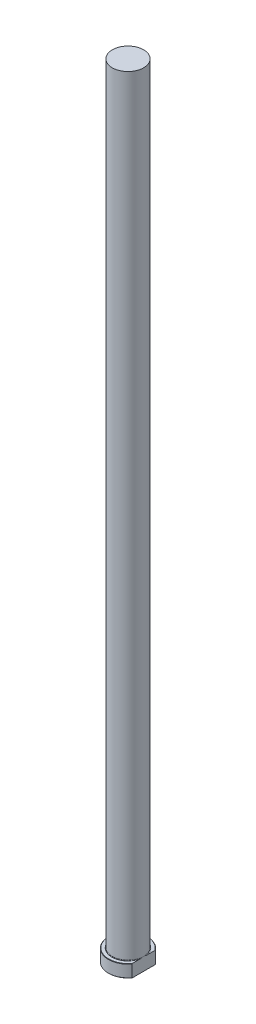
ISO-10303-21;
HEADER;
FILE_DESCRIPTION(('STEP AP214'),'2;1');
FILE_NAME('part.step','',(''),(''),'','','');
FILE_SCHEMA(('AUTOMOTIVE_DESIGN { 1 0 10303 214 1 1 1 1 }'));
ENDSEC;
DATA;
#1=APPLICATION_CONTEXT('core data for automotive mechanical design processes');
#2=APPLICATION_PROTOCOL_DEFINITION('international standard','automotive_design',2000,#1);
#3=PRODUCT_CONTEXT('',#1,'mechanical');
#4=PRODUCT('Part','Part','',(#3));
#5=PRODUCT_RELATED_PRODUCT_CATEGORY('part','',(#4));
#6=PRODUCT_DEFINITION_FORMATION('','',#4);
#7=PRODUCT_DEFINITION_CONTEXT('part definition',#1,'design');
#8=PRODUCT_DEFINITION('design','',#6,#7);
#9=PRODUCT_DEFINITION_SHAPE('','',#8);
#10=(LENGTH_UNIT() NAMED_UNIT(*) SI_UNIT(.MILLI.,.METRE.));
#11=(NAMED_UNIT(*) PLANE_ANGLE_UNIT() SI_UNIT($,.RADIAN.));
#12=(NAMED_UNIT(*) SI_UNIT($,.STERADIAN.) SOLID_ANGLE_UNIT());
#13=UNCERTAINTY_MEASURE_WITH_UNIT(LENGTH_MEASURE(1.E-05),#10,'distance_accuracy_value','');
#14=(GEOMETRIC_REPRESENTATION_CONTEXT(3) GLOBAL_UNCERTAINTY_ASSIGNED_CONTEXT((#13)) GLOBAL_UNIT_ASSIGNED_CONTEXT((#10,
#11,#12)) REPRESENTATION_CONTEXT('',''));
#15=CARTESIAN_POINT('',(0.,0.,0.));
#16=DIRECTION('',(0.,0.,1.));
#17=DIRECTION('',(1.,0.,0.));
#18=AXIS2_PLACEMENT_3D('',#15,#16,#17);
#19=CARTESIAN_POINT('',(0.,0.,0.));
#20=DIRECTION('',(0.,-1.,0.));
#21=DIRECTION('',(0.,0.,-1.));
#22=AXIS2_PLACEMENT_3D('',#19,#20,#21);
#23=PLANE('',#22);
#24=CARTESIAN_POINT('',(0.,0.,0.));
#25=DIRECTION('',(0.,-1.,0.));
#26=DIRECTION('',(0.,0.,-1.));
#27=AXIS2_PLACEMENT_3D('',#24,#25,#26);
#28=CIRCLE('',#27,12.3);
#29=CARTESIAN_POINT('',(9.99999999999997,0.,7.16170370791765));
#30=VERTEX_POINT('',#29);
#31=CARTESIAN_POINT('',(9.99999999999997,0.,-7.16170370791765));
#32=VERTEX_POINT('',#31);
#33=EDGE_CURVE('E98',#30,#32,#28,.T.);
#34=ORIENTED_EDGE('',*,*,#33,.T.);
#35=DIRECTION('',(0.,0.,1.));
#36=VECTOR('',#35,1.);
#37=CARTESIAN_POINT('',(9.99999999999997,0.,7.49999999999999));
#38=LINE('',#37,#36);
#39=EDGE_CURVE('E83',#32,#30,#38,.T.);
#40=ORIENTED_EDGE('',*,*,#39,.T.);
#41=EDGE_LOOP('',(#34,#40));
#42=FACE_BOUND('',#41,.T.);
#43=ADVANCED_FACE('F32',(#42),#23,.T.);
#44=CARTESIAN_POINT('',(0.,259.958771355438,0.));
#45=DIRECTION('',(0.,1.,0.));
#46=DIRECTION('',(0.,0.,1.));
#47=AXIS2_PLACEMENT_3D('',#44,#45,#46);
#48=CYLINDRICAL_SURFACE('',#47,12.5);
#49=CARTESIAN_POINT('',(0.,7.79999999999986,0.));
#50=DIRECTION('',(0.,1.,0.));
#51=DIRECTION('',(0.,0.,1.));
#52=AXIS2_PLACEMENT_3D('',#49,#50,#51);
#53=CIRCLE('',#52,12.5);
#54=CARTESIAN_POINT('',(9.99999999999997,7.79999999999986,7.49999999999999));
#55=VERTEX_POINT('',#54);
#56=CARTESIAN_POINT('',(9.99999999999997,7.79999999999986,-7.49999999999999));
#57=VERTEX_POINT('',#56);
#58=EDGE_CURVE('E104',#55,#57,#53,.F.);
#59=ORIENTED_EDGE('',*,*,#58,.T.);
#60=DIRECTION('',(0.,-1.,0.));
#61=VECTOR('',#60,1.);
#62=CARTESIAN_POINT('',(9.99999999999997,500.,-7.49999999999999));
#63=LINE('',#62,#61);
#64=CARTESIAN_POINT('',(9.99999999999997,0.199999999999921,-7.49999999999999));
#65=VERTEX_POINT('',#64);
#66=EDGE_CURVE('E183',#57,#65,#63,.T.);
#67=ORIENTED_EDGE('',*,*,#66,.T.);
#68=CARTESIAN_POINT('',(0.,0.199999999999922,0.));
#69=DIRECTION('',(0.,-1.,0.));
#70=DIRECTION('',(0.,0.,-1.));
#71=AXIS2_PLACEMENT_3D('',#68,#69,#70);
#72=CIRCLE('',#71,12.5);
#73=CARTESIAN_POINT('',(9.99999999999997,0.199999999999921,7.49999999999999));
#74=VERTEX_POINT('',#73);
#75=EDGE_CURVE('E100',#65,#74,#72,.F.);
#76=ORIENTED_EDGE('',*,*,#75,.T.);
#77=DIRECTION('',(0.,-1.,0.));
#78=VECTOR('',#77,1.);
#79=CARTESIAN_POINT('',(9.99999999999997,500.,7.49999999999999));
#80=LINE('',#79,#78);
#81=EDGE_CURVE('E93',#55,#74,#80,.T.);
#82=ORIENTED_EDGE('',*,*,#81,.F.);
#83=EDGE_LOOP('',(#59,#67,#76,#82));
#84=FACE_BOUND('',#83,.T.);
#85=ADVANCED_FACE('F158',(#84),#48,.T.);
#86=CARTESIAN_POINT('',(-12.5,8.,0.));
#87=DIRECTION('',(0.,1.,0.));
#88=DIRECTION('',(0.,0.,1.));
#89=AXIS2_PLACEMENT_3D('',#86,#87,#88);
#90=PLANE('',#89);
#91=CARTESIAN_POINT('',(0.,8.,0.));
#92=DIRECTION('',(0.,1.,0.));
#93=DIRECTION('',(0.,0.,1.));
#94=AXIS2_PLACEMENT_3D('',#91,#92,#93);
#95=CIRCLE('',#94,12.2999999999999);
#96=CARTESIAN_POINT('',(9.99999999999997,8.,-7.16170370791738));
#97=VERTEX_POINT('',#96);
#98=CARTESIAN_POINT('',(9.99999999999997,8.,7.16170370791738));
#99=VERTEX_POINT('',#98);
#100=EDGE_CURVE('E178',#97,#99,#95,.T.);
#101=ORIENTED_EDGE('',*,*,#100,.T.);
#102=DIRECTION('',(0.,0.,-1.));
#103=VECTOR('',#102,1.);
#104=CARTESIAN_POINT('',(9.99999999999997,8.,0.));
#105=LINE('',#104,#103);
#106=CARTESIAN_POINT('',(9.99999999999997,7.99999999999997,2.46779253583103));
#107=VERTEX_POINT('',#106);
#108=EDGE_CURVE('E57',#99,#107,#105,.T.);
#109=ORIENTED_EDGE('',*,*,#108,.T.);
#110=CARTESIAN_POINT('',(0.,8.,0.));
#111=DIRECTION('',(0.,1.,0.));
#112=DIRECTION('',(0.,0.,1.));
#113=AXIS2_PLACEMENT_3D('',#110,#111,#112);
#114=CIRCLE('',#113,10.3);
#115=CARTESIAN_POINT('',(9.99999999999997,7.99999999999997,-2.46779253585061));
#116=VERTEX_POINT('',#115);
#117=EDGE_CURVE('E107',#107,#116,#114,.F.);
#118=ORIENTED_EDGE('',*,*,#117,.T.);
#119=EDGE_CURVE('E136',#116,#97,#105,.T.);
#120=ORIENTED_EDGE('',*,*,#119,.T.);
#121=EDGE_LOOP('',(#101,#109,#118,#120));
#122=FACE_BOUND('',#121,.T.);
#123=ADVANCED_FACE('F147',(#122),#90,.T.);
#124=CARTESIAN_POINT('',(0.,8.00000000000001,0.));
#125=DIRECTION('',(0.,-1.,0.));
#126=DIRECTION('',(0.,0.,-1.));
#127=AXIS2_PLACEMENT_3D('',#124,#125,#126);
#128=CONICAL_SURFACE('',#127,12.2999999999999,0.78539816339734);
#129=ORIENTED_EDGE('',*,*,#58,.F.);
#130=CARTESIAN_POINT('',(9.99999999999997,1.00536344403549,16.5009999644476));
#131=CARTESIAN_POINT('',(9.99999999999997,1.21630498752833,16.2543355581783));
#132=CARTESIAN_POINT('',(9.99999999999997,1.42652357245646,16.0070509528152));
#133=CARTESIAN_POINT('',(9.99999999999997,1.84530552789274,15.5110762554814));
#134=CARTESIAN_POINT('',(9.99999999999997,2.05386886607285,15.2623861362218));
#135=CARTESIAN_POINT('',(9.99999999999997,2.46922929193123,14.7633169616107));
#136=CARTESIAN_POINT('',(9.99999999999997,2.67602541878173,14.5129371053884));
#137=CARTESIAN_POINT('',(9.99999999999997,3.08746949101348,14.0104232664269));
#138=CARTESIAN_POINT('',(9.99999999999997,3.29211744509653,13.7582892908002));
#139=CARTESIAN_POINT('',(9.99999999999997,3.91329356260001,12.9853872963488));
#140=CARTESIAN_POINT('',(9.99999999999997,4.32590780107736,12.4614457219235));
#141=CARTESIAN_POINT('',(9.99999999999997,4.9343290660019,11.667584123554));
#142=CARTESIAN_POINT('',(9.99999999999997,5.13536557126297,11.4016670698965));
#143=CARTESIAN_POINT('',(9.99999999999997,5.53332213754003,10.8667737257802));
#144=CARTESIAN_POINT('',(9.99999999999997,5.73024230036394,10.5977975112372));
#145=CARTESIAN_POINT('',(9.99999999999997,6.11958395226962,10.0558339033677));
#146=CARTESIAN_POINT('',(9.99999999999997,6.31199627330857,9.78283991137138));
#147=CARTESIAN_POINT('',(9.99999999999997,6.69098850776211,9.23281808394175));
#148=CARTESIAN_POINT('',(9.99999999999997,6.87756835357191,8.95579020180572));
#149=CARTESIAN_POINT('',(9.99999999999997,7.24386175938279,8.39686559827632));
#150=CARTESIAN_POINT('',(9.99999999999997,7.4235690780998,8.11496477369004));
#151=CARTESIAN_POINT('',(9.99999999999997,7.77442577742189,7.54587381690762));
#152=CARTESIAN_POINT('',(9.99999999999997,7.94557534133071,7.25868379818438));
#153=CARTESIAN_POINT('',(9.99999999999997,8.27579255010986,6.68110489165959));
#154=CARTESIAN_POINT('',(9.99999999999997,8.43496136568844,6.39077413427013));
#155=CARTESIAN_POINT('',(9.99999999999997,8.74070169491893,5.80346881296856));
#156=CARTESIAN_POINT('',(9.99999999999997,8.88727174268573,5.50649348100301));
#157=CARTESIAN_POINT('',(9.99999999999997,9.16464690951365,4.90580562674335));
#158=CARTESIAN_POINT('',(9.99999999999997,9.29547767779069,4.60210504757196));
#159=CARTESIAN_POINT('',(9.99999999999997,9.5381157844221,3.98721702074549));
#160=CARTESIAN_POINT('',(9.99999999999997,9.64992824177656,3.6760316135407));
#161=CARTESIAN_POINT('',(9.99999999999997,9.85377427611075,3.03618507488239));
#162=CARTESIAN_POINT('',(9.99999999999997,9.94506307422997,2.70728313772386));
#163=CARTESIAN_POINT('',(9.99999999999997,10.098612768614,2.04271295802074));
#164=CARTESIAN_POINT('',(9.99999999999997,10.1608782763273,1.70704579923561));
#165=CARTESIAN_POINT('',(9.99999999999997,10.2523345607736,1.03273145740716));
#166=CARTESIAN_POINT('',(9.99999999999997,10.2816771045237,0.694105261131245));
#167=CARTESIAN_POINT('',(9.99999999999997,10.305734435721,0.0156107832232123));
#168=CARTESIAN_POINT('',(9.99999999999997,10.3004504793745,-0.324257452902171));
#169=CARTESIAN_POINT('',(9.99999999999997,10.2556863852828,-1.00105364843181));
#170=CARTESIAN_POINT('',(9.99999999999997,10.2162696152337,-1.33798588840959));
#171=CARTESIAN_POINT('',(9.99999999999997,10.1059986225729,-2.00662252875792));
#172=CARTESIAN_POINT('',(9.99999999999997,10.0351392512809,-2.3383260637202));
#173=CARTESIAN_POINT('',(9.99999999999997,9.86555989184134,-2.99656485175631));
#174=CARTESIAN_POINT('',(9.99999999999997,9.76667373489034,-3.32305662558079));
#175=CARTESIAN_POINT('',(9.99999999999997,9.54578440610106,-3.96799531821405));
#176=CARTESIAN_POINT('',(9.99999999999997,9.42378209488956,-4.28644253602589));
#177=CARTESIAN_POINT('',(9.99999999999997,9.11799425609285,-5.01807395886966));
#178=CARTESIAN_POINT('',(9.99999999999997,8.92704202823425,-5.42824387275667));
#179=CARTESIAN_POINT('',(9.99999999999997,8.52007370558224,-6.23606279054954));
#180=CARTESIAN_POINT('',(9.99999999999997,8.30404206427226,-6.63370383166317));
#181=CARTESIAN_POINT('',(9.99999999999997,7.85262882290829,-7.41892362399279));
#182=CARTESIAN_POINT('',(9.99999999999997,7.61720565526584,-7.80647828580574));
#183=CARTESIAN_POINT('',(9.99999999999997,7.13198477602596,-8.57229930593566));
#184=CARTESIAN_POINT('',(9.99999999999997,6.88219017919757,-8.95056765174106));
#185=CARTESIAN_POINT('',(9.99999999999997,6.37025897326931,-9.70120273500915));
#186=CARTESIAN_POINT('',(9.99999999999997,6.10807036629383,-10.0735338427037));
#187=CARTESIAN_POINT('',(9.99999999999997,5.57484920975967,-10.8118088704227));
#188=CARTESIAN_POINT('',(9.99999999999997,5.30381628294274,-11.1777525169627));
#189=CARTESIAN_POINT('',(9.99999999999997,4.7550335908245,-11.9038819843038));
#190=CARTESIAN_POINT('',(9.99999999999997,4.47729204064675,-12.2640740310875));
#191=CARTESIAN_POINT('',(9.99999999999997,3.91614159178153,-12.979992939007));
#192=CARTESIAN_POINT('',(9.99999999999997,3.63273283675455,-13.3357199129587));
#193=CARTESIAN_POINT('',(9.99999999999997,3.15476557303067,-13.9276249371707));
#194=CARTESIAN_POINT('',(9.99999999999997,2.96147908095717,-14.1648328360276));
#195=CARTESIAN_POINT('',(9.99999999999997,2.57302271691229,-14.6377567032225));
#196=CARTESIAN_POINT('',(9.99999999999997,2.37785258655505,-14.8734724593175));
#197=CARTESIAN_POINT('',(9.99999999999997,1.98727926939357,-15.3418493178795));
#198=CARTESIAN_POINT('',(9.99999999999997,1.79188780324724,-15.574520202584));
#199=CARTESIAN_POINT('',(9.99999999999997,1.39966350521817,-16.0386421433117));
#200=CARTESIAN_POINT('',(9.99999999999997,1.2028306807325,-16.2700932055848));
#201=CARTESIAN_POINT('',(9.99999999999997,1.00536344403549,-16.5009999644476));
#202=B_SPLINE_CURVE_WITH_KNOTS('',3,(#130,#131,#132,#133,#134,#135,#136,#137,#138,#139,#140,
#141,#142,#143,#144,#145,#146,#147,#148,#149,#150,#151,#152,#153,#154,#155,#156,#157,#158,#159,
#160,#161,#162,#163,#164,#165,#166,#167,#168,#169,#170,#171,#172,#173,#174,#175,#176,#177,#178,
#179,#180,#181,#182,#183,#184,#185,#186,#187,#188,#189,#190,#191,#192,#193,#194,#195,#196,#197,
#198,#199,#200,#201),.UNSPECIFIED.,.F.,.F.,(4,2,2,2,2,2,2,2,2,2,2,2,2,2,2,2,2,2,2,2,2,2,2,2,2,2,
2,2,2,2,2,2,2,2,2,4),(0.,0.973682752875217,1.94738447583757,2.92158563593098,3.89578284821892,
5.89629098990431,6.89633497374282,7.89635419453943,8.898256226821,9.90016986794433,
10.9029727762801,11.9057541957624,12.8987995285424,13.8919602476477,14.883479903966,
15.8747322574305,16.8976074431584,17.9203200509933,18.9382985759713,19.9562401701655,
20.9722959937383,21.9885182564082,23.0108964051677,24.0332364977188,25.3893591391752,
26.7463269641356,28.106283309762,29.4659460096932,30.8319323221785,32.1979769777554,
33.5624260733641,34.9268406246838,35.8447887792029,36.7628646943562,37.6743531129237,
38.5858368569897),.UNSPECIFIED.);
#203=EDGE_CURVE('E135',#55,#99,#202,.T.);
#204=ORIENTED_EDGE('',*,*,#203,.T.);
#205=ORIENTED_EDGE('',*,*,#100,.F.);
#206=EDGE_CURVE('E127',#97,#57,#202,.T.);
#207=ORIENTED_EDGE('',*,*,#206,.T.);
#208=EDGE_LOOP('',(#129,#204,#205,#207));
#209=FACE_BOUND('',#208,.T.);
#210=ADVANCED_FACE('F143',(#209),#128,.T.);
#211=CARTESIAN_POINT('',(0.,0.199999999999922,0.));
#212=DIRECTION('',(0.,1.,0.));
#213=DIRECTION('',(0.,0.,1.));
#214=AXIS2_PLACEMENT_3D('',#211,#212,#213);
#215=CONICAL_SURFACE('',#214,12.5,0.785398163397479);
#216=ORIENTED_EDGE('',*,*,#75,.F.);
#217=CARTESIAN_POINT('',(9.99999999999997,6.9946365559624,-16.5009999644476));
#218=CARTESIAN_POINT('',(9.99999999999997,6.78369501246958,-16.2543355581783));
#219=CARTESIAN_POINT('',(9.99999999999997,6.57347642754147,-16.0070509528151));
#220=CARTESIAN_POINT('',(9.99999999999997,6.15469447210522,-15.5110762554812));
#221=CARTESIAN_POINT('',(9.99999999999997,5.94613113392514,-15.2623861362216));
#222=CARTESIAN_POINT('',(9.99999999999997,5.53077070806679,-14.7633169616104));
#223=CARTESIAN_POINT('',(9.99999999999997,5.32397458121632,-14.512937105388));
#224=CARTESIAN_POINT('',(9.99999999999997,4.91253050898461,-14.0104232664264));
#225=CARTESIAN_POINT('',(9.99999999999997,4.70788255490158,-13.7582892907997));
#226=CARTESIAN_POINT('',(9.99999999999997,4.08670643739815,-12.9853872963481));
#227=CARTESIAN_POINT('',(9.99999999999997,3.67409219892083,-12.4614457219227));
#228=CARTESIAN_POINT('',(9.99999999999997,3.06567093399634,-11.667584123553));
#229=CARTESIAN_POINT('',(9.99999999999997,2.86463442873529,-11.4016670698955));
#230=CARTESIAN_POINT('',(9.99999999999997,2.46667786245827,-10.8667737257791));
#231=CARTESIAN_POINT('',(9.99999999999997,2.26975769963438,-10.5977975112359));
#232=CARTESIAN_POINT('',(9.99999999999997,1.88041604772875,-10.0558339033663));
#233=CARTESIAN_POINT('',(9.99999999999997,1.68800372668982,-9.78283991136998));
#234=CARTESIAN_POINT('',(9.99999999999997,1.30901149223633,-9.23281808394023));
#235=CARTESIAN_POINT('',(9.99999999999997,1.12243164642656,-8.95579020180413));
#236=CARTESIAN_POINT('',(9.99999999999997,0.756138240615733,-8.3968655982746));
#237=CARTESIAN_POINT('',(9.99999999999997,0.576430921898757,-8.11496477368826));
#238=CARTESIAN_POINT('',(9.99999999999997,0.22557422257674,-7.54587381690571));
#239=CARTESIAN_POINT('',(9.99999999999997,0.0544246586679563,-7.25868379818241));
#240=CARTESIAN_POINT('',(9.99999999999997,-0.275792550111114,-6.68110489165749));
#241=CARTESIAN_POINT('',(9.99999999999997,-0.434961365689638,-6.39077413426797));
#242=CARTESIAN_POINT('',(9.99999999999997,-0.740701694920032,-5.80346881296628));
#243=CARTESIAN_POINT('',(9.99999999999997,-0.887271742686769,-5.50649348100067));
#244=CARTESIAN_POINT('',(9.99999999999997,-1.16464690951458,-4.90580562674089));
#245=CARTESIAN_POINT('',(9.99999999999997,-1.29547767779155,-4.60210504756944));
#246=CARTESIAN_POINT('',(9.99999999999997,-1.53811578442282,-3.98721702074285));
#247=CARTESIAN_POINT('',(9.99999999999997,-1.64992824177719,-3.67603161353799));
#248=CARTESIAN_POINT('',(9.99999999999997,-1.85377427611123,-3.03618507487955));
#249=CARTESIAN_POINT('',(9.99999999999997,-1.94506307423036,-2.70728313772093));
#250=CARTESIAN_POINT('',(9.99999999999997,-2.09861276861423,-2.04271295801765));
#251=CARTESIAN_POINT('',(9.99999999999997,-2.1608782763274,-1.70704579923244));
#252=CARTESIAN_POINT('',(9.99999999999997,-2.25233456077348,-1.03273145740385));
#253=CARTESIAN_POINT('',(9.99999999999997,-2.28167710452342,-0.694105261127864));
#254=CARTESIAN_POINT('',(9.99999999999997,-2.30573443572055,-0.0156107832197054));
#255=CARTESIAN_POINT('',(9.99999999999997,-2.30045047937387,0.324257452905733));
#256=CARTESIAN_POINT('',(9.99999999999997,-2.25568638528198,1.00105364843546));
#257=CARTESIAN_POINT('',(9.99999999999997,-2.21626961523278,1.33798588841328));
#258=CARTESIAN_POINT('',(9.99999999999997,-2.10599862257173,2.00662252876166));
#259=CARTESIAN_POINT('',(9.99999999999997,-2.03513925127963,2.33832606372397));
#260=CARTESIAN_POINT('',(9.99999999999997,-1.86555989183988,2.99656485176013));
#261=CARTESIAN_POINT('',(9.99999999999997,-1.76667373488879,3.32305662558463));
#262=CARTESIAN_POINT('',(9.99999999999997,-1.54578440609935,3.96799531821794));
#263=CARTESIAN_POINT('',(9.99999999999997,-1.42378209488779,4.2864425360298));
#264=CARTESIAN_POINT('',(9.99999999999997,-1.11799425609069,5.01807395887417));
#265=CARTESIAN_POINT('',(9.99999999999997,-0.927042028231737,5.42824387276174));
#266=CARTESIAN_POINT('',(9.99999999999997,-0.520073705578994,6.23606279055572));
#267=CARTESIAN_POINT('',(9.99999999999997,-0.304042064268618,6.6337038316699));
#268=CARTESIAN_POINT('',(9.99999999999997,0.147371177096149,7.41892362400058));
#269=CARTESIAN_POINT('',(9.99999999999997,0.382794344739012,7.80647828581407));
#270=CARTESIAN_POINT('',(9.99999999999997,0.868015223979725,8.57229930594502));
#271=CARTESIAN_POINT('',(9.99999999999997,1.11780982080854,8.95056765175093));
#272=CARTESIAN_POINT('',(9.99999999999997,1.62974102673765,9.70120273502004));
#273=CARTESIAN_POINT('',(9.99999999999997,1.89192963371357,10.0735338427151));
#274=CARTESIAN_POINT('',(9.99999999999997,2.4251507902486,10.8118088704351));
#275=CARTESIAN_POINT('',(9.99999999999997,2.69618371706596,11.1777525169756));
#276=CARTESIAN_POINT('',(9.99999999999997,3.24496640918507,11.9038819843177));
#277=CARTESIAN_POINT('',(9.99999999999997,3.52270795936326,12.2640740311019));
#278=CARTESIAN_POINT('',(9.99999999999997,4.08385840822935,12.9799929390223));
#279=CARTESIAN_POINT('',(9.99999999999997,4.36726716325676,13.3357199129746));
#280=CARTESIAN_POINT('',(9.99999999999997,4.84523442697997,13.9276249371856));
#281=CARTESIAN_POINT('',(9.99999999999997,5.03852091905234,14.1648328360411));
#282=CARTESIAN_POINT('',(9.99999999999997,5.42697728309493,14.6377567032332));
#283=CARTESIAN_POINT('',(9.99999999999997,5.62214741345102,14.8734724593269));
#284=CARTESIAN_POINT('',(9.99999999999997,6.01272073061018,15.3418493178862));
#285=CARTESIAN_POINT('',(9.99999999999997,6.20811219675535,15.5745202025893));
#286=CARTESIAN_POINT('',(9.99999999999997,6.60033649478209,16.0386421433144));
#287=CARTESIAN_POINT('',(9.99999999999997,6.79716931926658,16.2700932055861));
#288=CARTESIAN_POINT('',(9.99999999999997,6.9946365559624,16.5009999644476));
#289=B_SPLINE_CURVE_WITH_KNOTS('',3,(#217,#218,#219,#220,#221,#222,#223,#224,#225,#226,#227,
#228,#229,#230,#231,#232,#233,#234,#235,#236,#237,#238,#239,#240,#241,#242,#243,#244,#245,#246,
#247,#248,#249,#250,#251,#252,#253,#254,#255,#256,#257,#258,#259,#260,#261,#262,#263,#264,#265,
#266,#267,#268,#269,#270,#271,#272,#273,#274,#275,#276,#277,#278,#279,#280,#281,#282,#283,#284,
#285,#286,#287,#288),.UNSPECIFIED.,.F.,.F.,(4,2,2,2,2,2,2,2,2,2,2,2,2,2,2,2,2,2,2,2,2,2,2,2,2,2,
2,2,2,2,2,2,2,2,2,4),(0.,0.97368275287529,1.94738447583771,2.9215856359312,3.89578284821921,
5.89629098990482,6.89633497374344,7.89635419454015,8.89825622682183,9.90016986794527,
10.9029727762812,11.9057541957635,12.8987995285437,13.891960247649,14.8834799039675,
15.874732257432,16.8976074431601,17.9203200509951,18.9382985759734,19.9562401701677,
20.9722959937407,21.9885182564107,23.0108964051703,24.0332364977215,25.3893591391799,
26.7463269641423,28.1062833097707,29.4659460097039,30.8319323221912,32.1979769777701,
33.5624260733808,34.9268406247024,35.8447887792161,36.762864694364,37.6743531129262,
38.5858368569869),.UNSPECIFIED.);
#290=EDGE_CURVE('E86',#65,#32,#289,.T.);
#291=ORIENTED_EDGE('',*,*,#290,.T.);
#292=ORIENTED_EDGE('',*,*,#33,.F.);
#293=EDGE_CURVE('E89',#30,#74,#289,.T.);
#294=ORIENTED_EDGE('',*,*,#293,.T.);
#295=EDGE_LOOP('',(#216,#291,#292,#294));
#296=FACE_BOUND('',#295,.T.);
#297=ADVANCED_FACE('F97',(#296),#215,.T.);
#298=CARTESIAN_POINT('',(0.,8.29999999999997,0.));
#299=DIRECTION('',(0.,1.,0.));
#300=DIRECTION('',(0.,0.,1.));
#301=AXIS2_PLACEMENT_3D('',#298,#299,#300);
#302=TOROIDAL_SURFACE('',#301,10.3,0.3);
#303=CARTESIAN_POINT('',(9.99999999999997,8.29999999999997,0.));
#304=CARTESIAN_POINT('',(9.99999999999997,8.30000063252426,1.28949011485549E-10));
#305=CARTESIAN_POINT('',(9.99999999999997,8.30000126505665,-4.00092969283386E-07));
#306=CARTESIAN_POINT('',(9.99999999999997,8.30000243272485,-1.40234425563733E-06));
#307=CARTESIAN_POINT('',(9.99999999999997,8.30000291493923,-2.02945829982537E-06));
#308=CARTESIAN_POINT('',(9.99999999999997,8.30000399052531,-3.57386637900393E-06));
#309=CARTESIAN_POINT('',(9.99999999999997,8.30000456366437,-4.51585826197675E-06));
#310=CARTESIAN_POINT('',(9.99999999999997,8.30000552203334,-6.39352371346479E-06));
#311=CARTESIAN_POINT('',(9.99999999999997,8.30000591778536,-7.32481314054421E-06));
#312=CARTESIAN_POINT('',(9.99999999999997,8.30000752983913,-1.11866732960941E-05));
#313=CARTESIAN_POINT('',(9.99999999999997,8.30000869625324,-1.41456080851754E-05));
#314=CARTESIAN_POINT('',(9.99999999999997,8.30001046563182,-1.98041773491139E-05));
#315=CARTESIAN_POINT('',(9.99999999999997,8.30001112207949,-2.24876182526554E-05));
#316=CARTESIAN_POINT('',(9.99999999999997,8.30001410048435,-3.4483482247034E-05));
#317=CARTESIAN_POINT('',(9.99999999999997,8.30001652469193,-4.37702049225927E-05));
#318=CARTESIAN_POINT('',(9.99999999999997,8.30001986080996,-6.08623697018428E-05));
#319=CARTESIAN_POINT('',(9.99999999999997,8.30002096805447,-6.86285926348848E-05));
#320=CARTESIAN_POINT('',(9.99999999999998,8.30002934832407,-0.000128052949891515));
#321=CARTESIAN_POINT('',(9.99999999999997,8.30003610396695,-0.000179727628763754));
#322=CARTESIAN_POINT('',(9.99999999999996,8.30006561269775,-0.000386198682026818));
#323=CARTESIAN_POINT('',(9.99999999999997,8.30009331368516,-0.00054031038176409));
#324=CARTESIAN_POINT('',(9.99999999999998,8.30020264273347,-0.00115673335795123));
#325=CARTESIAN_POINT('',(9.99999999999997,8.30028138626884,-0.00161935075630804));
#326=CARTESIAN_POINT('',(9.99999999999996,8.30059961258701,-0.00347761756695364));
#327=CARTESIAN_POINT('',(9.99999999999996,8.30084290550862,-0.00487283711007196));
#328=CARTESIAN_POINT('',(9.99999999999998,8.30186502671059,-0.0107472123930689));
#329=CARTESIAN_POINT('',(9.99999999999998,8.30263902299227,-0.0152269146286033));
#330=CARTESIAN_POINT('',(9.99999999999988,8.31278939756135,-0.0739588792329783));
#331=CARTESIAN_POINT('',(9.99999999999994,8.32219581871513,-0.128207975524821));
#332=CARTESIAN_POINT('',(10.,8.34198671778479,-0.24289459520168));
#333=CARTESIAN_POINT('',(9.99999999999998,8.35236068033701,-0.303333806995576));
#334=CARTESIAN_POINT('',(9.99999999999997,8.36977130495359,-0.405616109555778));
#335=CARTESIAN_POINT('',(9.99999999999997,8.3768514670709,-0.447451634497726));
#336=CARTESIAN_POINT('',(9.99999999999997,8.39069208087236,-0.529918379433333));
#337=CARTESIAN_POINT('',(9.99999999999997,8.39745582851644,-0.570549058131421));
#338=CARTESIAN_POINT('',(9.99999999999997,8.43524949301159,-0.799879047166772));
#339=CARTESIAN_POINT('',(9.99999999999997,8.46492511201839,-0.988816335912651));
#340=CARTESIAN_POINT('',(9.99999999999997,8.50514159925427,-1.27416595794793));
#341=CARTESIAN_POINT('',(9.99999999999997,8.5179022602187,-1.37026272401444));
#342=CARTESIAN_POINT('',(9.99999999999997,8.54137601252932,-1.56269877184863));
#343=CARTESIAN_POINT('',(9.99999999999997,8.55208934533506,-1.65903802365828));
#344=CARTESIAN_POINT('',(9.99999999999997,8.57171635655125,-1.86082905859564));
#345=CARTESIAN_POINT('',(9.99999999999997,8.58037484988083,-1.96630619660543));
#346=CARTESIAN_POINT('',(9.99999999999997,8.59347501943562,-2.17764173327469));
#347=CARTESIAN_POINT('',(9.99999999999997,8.59791297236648,-2.28350038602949));
#348=CARTESIAN_POINT('',(9.99999999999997,8.60018116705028,-2.44194031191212));
#349=CARTESIAN_POINT('',(9.99999999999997,8.60021412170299,-2.49449016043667));
#350=CARTESIAN_POINT('',(9.99999999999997,8.5985468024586,-2.59955991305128));
#351=CARTESIAN_POINT('',(9.99999999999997,8.59684676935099,-2.65207982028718));
#352=CARTESIAN_POINT('',(9.99999999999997,8.59132943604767,-2.75692923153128));
#353=CARTESIAN_POINT('',(9.99999999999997,8.58751547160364,-2.80925890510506));
#354=CARTESIAN_POINT('',(9.99999999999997,8.57721394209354,-2.91364681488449));
#355=CARTESIAN_POINT('',(9.99999999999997,8.57072778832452,-2.96570517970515));
#356=CARTESIAN_POINT('',(9.99999999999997,8.55845909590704,-3.04236198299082));
#357=CARTESIAN_POINT('',(9.99999999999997,8.55406015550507,-3.06718232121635));
#358=CARTESIAN_POINT('',(9.99999999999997,8.54426309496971,-3.11664708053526));
#359=CARTESIAN_POINT('',(9.99999999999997,8.53886425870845,-3.14129136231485));
#360=CARTESIAN_POINT('',(9.99999999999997,8.52688550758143,-3.19015398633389));
#361=CARTESIAN_POINT('',(9.99999999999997,8.52031210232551,-3.21437390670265));
#362=CARTESIAN_POINT('',(9.99999999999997,8.50565284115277,-3.26234404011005));
#363=CARTESIAN_POINT('',(9.99999999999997,8.49756823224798,-3.28609462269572));
#364=CARTESIAN_POINT('',(9.99999999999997,8.47930616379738,-3.33303874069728));
#365=CARTESIAN_POINT('',(9.99999999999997,8.46910978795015,-3.35622496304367));
#366=CARTESIAN_POINT('',(9.99999999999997,8.44583688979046,-3.40109767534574));
#367=CARTESIAN_POINT('',(9.99999999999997,8.43277518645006,-3.42279115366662));
#368=CARTESIAN_POINT('',(9.99999999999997,8.4123442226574,-3.44947282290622));
#369=CARTESIAN_POINT('',(9.99999999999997,8.40696910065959,-3.45597309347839));
#370=CARTESIAN_POINT('',(9.99999999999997,8.39560437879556,-3.46843629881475));
#371=CARTESIAN_POINT('',(9.99999999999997,8.38961405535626,-3.4743985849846));
#372=CARTESIAN_POINT('',(9.99999999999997,8.37686927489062,-3.48560282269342));
#373=CARTESIAN_POINT('',(9.99999999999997,8.37010747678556,-3.49083658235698));
#374=CARTESIAN_POINT('',(9.99999999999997,8.35581596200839,-3.50012893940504));
#375=CARTESIAN_POINT('',(9.99999999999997,8.3482883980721,-3.50419071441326));
#376=CARTESIAN_POINT('',(9.99999999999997,8.33495256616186,-3.50966904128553));
#377=CARTESIAN_POINT('',(9.99999999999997,8.32932210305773,-3.51151465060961));
#378=CARTESIAN_POINT('',(9.99999999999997,8.3178331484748,-3.51424608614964));
#379=CARTESIAN_POINT('',(9.99999999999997,8.31197492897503,-3.5151330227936));
#380=CARTESIAN_POINT('',(9.99999999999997,8.3001712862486,-3.51585458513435));
#381=CARTESIAN_POINT('',(9.99999999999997,8.29422562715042,-3.5156854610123));
#382=CARTESIAN_POINT('',(9.99999999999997,8.28245600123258,-3.5143060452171));
#383=CARTESIAN_POINT('',(9.99999999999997,8.27663212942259,-3.51309496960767));
#384=CARTESIAN_POINT('',(9.99999999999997,8.26408629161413,-3.50941038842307));
#385=CARTESIAN_POINT('',(9.99999999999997,8.25742641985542,-3.50672823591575));
#386=CARTESIAN_POINT('',(9.99999999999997,8.24462824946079,-3.50032629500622));
#387=CARTESIAN_POINT('',(9.99999999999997,8.23849100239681,-3.49660447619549));
#388=CARTESIAN_POINT('',(9.99999999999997,8.22322836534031,-3.48593836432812));
#389=CARTESIAN_POINT('',(9.99999999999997,8.21452212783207,-3.47840118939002));
#390=CARTESIAN_POINT('',(9.99999999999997,8.19829740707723,-3.46215047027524));
#391=CARTESIAN_POINT('',(9.99999999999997,8.19078248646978,-3.45343353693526));
#392=CARTESIAN_POINT('',(9.99999999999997,8.16907103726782,-3.42543186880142));
#393=CARTESIAN_POINT('',(9.99999999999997,8.15646161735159,-3.40493410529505));
#394=CARTESIAN_POINT('',(9.99999999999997,8.13394130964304,-3.36256849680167));
#395=CARTESIAN_POINT('',(9.99999999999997,8.12403585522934,-3.34069800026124));
#396=CARTESIAN_POINT('',(9.99999999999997,8.10001076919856,-3.28102790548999));
#397=CARTESIAN_POINT('',(9.99999999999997,8.08762395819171,-3.24253659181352));
#398=CARTESIAN_POINT('',(9.99999999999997,8.06625855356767,-3.16459452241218));
#399=CARTESIAN_POINT('',(9.99999999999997,8.05728845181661,-3.12514163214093));
#400=CARTESIAN_POINT('',(9.99999999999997,8.04173697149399,-3.04517405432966));
#401=CARTESIAN_POINT('',(9.99999999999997,8.03519245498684,-3.00465227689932));
#402=CARTESIAN_POINT('',(9.99999999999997,8.0240941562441,-2.9234105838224));
#403=CARTESIAN_POINT('',(9.99999999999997,8.01953740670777,-2.88269105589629));
#404=CARTESIAN_POINT('',(9.99999999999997,8.00795421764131,-2.75734530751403));
#405=CARTESIAN_POINT('',(9.99999999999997,8.00352270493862,-2.67248037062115));
#406=CARTESIAN_POINT('',(9.99999999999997,7.9993551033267,-2.50262077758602));
#407=CARTESIAN_POINT('',(9.99999999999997,7.99962236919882,-2.41762607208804));
#408=CARTESIAN_POINT('',(9.99999999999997,8.00371104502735,-2.24733475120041));
#409=CARTESIAN_POINT('',(9.99999999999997,8.00754894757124,-2.16203856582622));
#410=CARTESIAN_POINT('',(9.99999999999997,8.01800314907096,-1.99161257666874));
#411=CARTESIAN_POINT('',(9.99999999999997,8.02461987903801,-1.90648280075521));
#412=CARTESIAN_POINT('',(9.99999999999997,8.0464317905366,-1.66587956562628));
#413=CARTESIAN_POINT('',(9.99999999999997,8.06418968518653,-1.51064125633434));
#414=CARTESIAN_POINT('',(9.99999999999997,8.10422160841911,-1.20249798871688));
#415=CARTESIAN_POINT('',(9.99999999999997,8.12644437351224,-1.04958602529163));
#416=CARTESIAN_POINT('',(9.99999999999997,8.15948239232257,-0.83624338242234));
#417=CARTESIAN_POINT('',(9.99999999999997,8.16909985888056,-0.775623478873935));
#418=CARTESIAN_POINT('',(9.99999999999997,8.18897079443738,-0.652687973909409));
#419=CARTESIAN_POINT('',(9.99999999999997,8.19923461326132,-0.590374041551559));
#420=CARTESIAN_POINT('',(9.99999999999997,8.21713663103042,-0.483134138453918));
#421=CARTESIAN_POINT('',(9.99999999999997,8.22471025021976,-0.43819731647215));
#422=CARTESIAN_POINT('',(9.99999999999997,8.23987729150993,-0.348851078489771));
#423=CARTESIAN_POINT('',(9.99999999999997,8.24746951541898,-0.304441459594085));
#424=CARTESIAN_POINT('',(9.99999999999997,8.26182028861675,-0.220832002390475));
#425=CARTESIAN_POINT('',(9.99999999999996,8.26857235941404,-0.181631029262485));
#426=CARTESIAN_POINT('',(9.99999999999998,8.28242621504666,-0.10152434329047));
#427=CARTESIAN_POINT('',(10.,8.28953038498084,-0.0606190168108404));
#428=CARTESIAN_POINT('',(9.99999999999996,8.29736053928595,-0.015220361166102));
#429=CARTESIAN_POINT('',(9.99999999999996,8.29813373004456,-0.010734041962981));
#430=CARTESIAN_POINT('',(9.99999999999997,8.29916055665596,-0.00485912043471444));
#431=CARTESIAN_POINT('',(9.99999999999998,8.29940456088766,-0.00346907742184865));
#432=CARTESIAN_POINT('',(9.99999999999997,8.2997182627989,-0.00161621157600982));
#433=CARTESIAN_POINT('',(9.99999999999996,8.2997954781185,-0.00115451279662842));
#434=CARTESIAN_POINT('',(9.99999999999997,8.2999075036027,-0.000539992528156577));
#435=CARTESIAN_POINT('',(9.99999999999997,8.29993630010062,-0.000386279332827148));
#436=CARTESIAN_POINT('',(9.99999999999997,8.29996329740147,-0.000179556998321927));
#437=CARTESIAN_POINT('',(9.99999999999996,8.29996909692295,-0.000127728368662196));
#438=CARTESIAN_POINT('',(9.99999999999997,8.29998090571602,-5.92319131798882E-05));
#439=CARTESIAN_POINT('',(9.99999999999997,8.29998420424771,-4.21300597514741E-05));
#440=CARTESIAN_POINT('',(9.99999999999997,8.29998884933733,-2.24947631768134E-05));
#441=CARTESIAN_POINT('',(9.99999999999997,8.29998949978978,-1.98237697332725E-05));
#442=CARTESIAN_POINT('',(9.99999999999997,8.29999127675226,-1.41671548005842E-05));
#443=CARTESIAN_POINT('',(9.99999999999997,8.29999246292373,-1.11998613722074E-05));
#444=CARTESIAN_POINT('',(9.99999999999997,8.29999408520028,-7.3251017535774E-06));
#445=CARTESIAN_POINT('',(9.99999999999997,8.29999448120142,-6.39283794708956E-06));
#446=CARTESIAN_POINT('',(9.99999999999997,8.2999954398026,-4.5130227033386E-06));
#447=CARTESIAN_POINT('',(9.99999999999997,8.29999601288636,-3.56982577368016E-06));
#448=CARTESIAN_POINT('',(9.99999999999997,8.29999708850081,-2.02579413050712E-06));
#449=CARTESIAN_POINT('',(9.99999999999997,8.29999757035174,-1.39989056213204E-06));
#450=CARTESIAN_POINT('',(9.99999999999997,8.29999873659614,-3.99573199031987E-07));
#451=CARTESIAN_POINT('',(9.99999999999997,8.29999936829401,-1.28782184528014E-10));
#452=CARTESIAN_POINT('',(9.99999999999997,8.29999999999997,0.));
#453=B_SPLINE_CURVE_WITH_KNOTS('',3,(#303,#304,#305,#306,#307,#308,#309,#310,#311,#312,#313,
#314,#315,#316,#317,#318,#319,#320,#321,#322,#323,#324,#325,#326,#327,#328,#329,#330,#331,#332,
#333,#334,#335,#336,#337,#338,#339,#340,#341,#342,#343,#344,#345,#346,#347,#348,#349,#350,#351,
#352,#353,#354,#355,#356,#357,#358,#359,#360,#361,#362,#363,#364,#365,#366,#367,#368,#369,#370,
#371,#372,#373,#374,#375,#376,#377,#378,#379,#380,#381,#382,#383,#384,#385,#386,#387,#388,#389,
#390,#391,#392,#393,#394,#395,#396,#397,#398,#399,#400,#401,#402,#403,#404,#405,#406,#407,#408,
#409,#410,#411,#412,#413,#414,#415,#416,#417,#418,#419,#420,#421,#422,#423,#424,#425,#426,#427,
#428,#429,#430,#431,#432,#433,#434,#435,#436,#437,#438,#439,#440,#441,#442,#443,#444,#445,#446,
#447,#448,#449,#450,#451,#452),.UNSPECIFIED.,.T.,.F.,(4,2,2,2,2,2,2,2,2,2,2,2,2,2,2,2,2,2,2,2,2,
2,2,2,2,2,2,2,2,2,2,2,2,2,2,2,2,2,2,2,2,2,2,2,2,2,2,2,2,2,2,2,2,2,2,2,2,2,2,2,2,2,2,2,2,2,2,2,2,
2,2,2,2,2,4),(0.,1.98246495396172E-06,4.40569524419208E-06,7.6777665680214E-06,
1.07153704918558E-05,2.02306836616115E-05,2.85109372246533E-05,5.72781943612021E-05,
8.07917065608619E-05,0.000237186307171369,0.00070671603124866,0.00211476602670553,
0.00636329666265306,0.020001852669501,0.185174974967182,0.369144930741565,0.496435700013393,
0.620005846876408,1.19369866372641,1.48450372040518,1.77527445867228,2.0927142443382,
2.41043381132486,2.56806178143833,2.7256678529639,2.88302592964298,3.04030100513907,
3.11590708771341,3.19156753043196,3.26682097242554,3.34201258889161,3.41790937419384,
3.49342251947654,3.5186974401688,3.54400243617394,3.56957226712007,3.59507210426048,
3.61277731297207,3.63046199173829,3.64820950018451,3.66597037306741,3.68738951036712,
3.70885077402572,3.74320167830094,3.77765344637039,3.84944920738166,3.92138819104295,
4.04238665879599,4.16368392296,4.28675554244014,4.40964280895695,4.66436434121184,
4.91926774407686,5.1753544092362,5.43148080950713,5.900100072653,6.36361828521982,
6.54775191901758,6.73721153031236,6.87392319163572,7.00908476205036,7.12841975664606,
7.25297120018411,7.26662883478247,7.27086249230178,7.27226698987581,7.27273594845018,
7.27289226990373,7.2729445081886,7.27295274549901,7.27296230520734,7.27296534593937,
7.27296862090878,7.2729710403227,7.27297302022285),.UNSPECIFIED.);
#454=CARTESIAN_POINT('',(9.99999999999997,8.29999999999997,0.));
#455=VERTEX_POINT('',#454);
#456=EDGE_CURVE('E11',#116,#455,#453,.T.);
#457=ORIENTED_EDGE('',*,*,#456,.F.);
#458=ORIENTED_EDGE('',*,*,#117,.F.);
#459=CARTESIAN_POINT('',(9.99999999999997,8.29999999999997,0.));
#460=CARTESIAN_POINT('',(9.99999999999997,8.29999936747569,-1.28948982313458E-10));
#461=CARTESIAN_POINT('',(9.99999999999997,8.29999873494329,4.00092969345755E-07));
#462=CARTESIAN_POINT('',(9.99999999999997,8.2999975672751,1.40234425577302E-06));
#463=CARTESIAN_POINT('',(9.99999999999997,8.29999708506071,2.02945829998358E-06));
#464=CARTESIAN_POINT('',(9.99999999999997,8.29999600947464,3.57386637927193E-06));
#465=CARTESIAN_POINT('',(9.99999999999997,8.29999543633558,4.51585826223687E-06));
#466=CARTESIAN_POINT('',(9.99999999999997,8.29999447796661,6.39352371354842E-06));
#467=CARTESIAN_POINT('',(9.99999999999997,8.29999408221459,7.32481314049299E-06));
#468=CARTESIAN_POINT('',(9.99999999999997,8.29999247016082,1.11866732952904E-05));
#469=CARTESIAN_POINT('',(9.99999999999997,8.29999130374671,1.41456080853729E-05));
#470=CARTESIAN_POINT('',(9.99999999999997,8.29998953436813,1.9804177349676E-05));
#471=CARTESIAN_POINT('',(9.99999999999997,8.29998887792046,2.24876182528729E-05));
#472=CARTESIAN_POINT('',(9.99999999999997,8.29998589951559,3.44834822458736E-05));
#473=CARTESIAN_POINT('',(9.99999999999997,8.29998347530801,4.37702049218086E-05));
#474=CARTESIAN_POINT('',(9.99999999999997,8.29998013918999,6.08623697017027E-05));
#475=CARTESIAN_POINT('',(9.99999999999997,8.29997903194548,6.86285926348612E-05));
#476=CARTESIAN_POINT('',(9.99999999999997,8.2999706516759,0.000128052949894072));
#477=CARTESIAN_POINT('',(9.99999999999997,8.299963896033,0.000179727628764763));
#478=CARTESIAN_POINT('',(9.99999999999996,8.29993438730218,0.000386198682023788));
#479=CARTESIAN_POINT('',(9.99999999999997,8.29990668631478,0.000540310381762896));
#480=CARTESIAN_POINT('',(9.99999999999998,8.2997973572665,0.00115673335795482));
#481=CARTESIAN_POINT('',(9.99999999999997,8.29971861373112,0.00161935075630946));
#482=CARTESIAN_POINT('',(9.99999999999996,8.29940038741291,0.00347761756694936));
#483=CARTESIAN_POINT('',(9.99999999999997,8.29915709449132,0.00487283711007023));
#484=CARTESIAN_POINT('',(9.99999999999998,8.2981349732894,0.0107472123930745));
#485=CARTESIAN_POINT('',(9.99999999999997,8.2973609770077,0.0152269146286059));
#486=CARTESIAN_POINT('',(9.9999999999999,8.28721060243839,0.0739588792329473));
#487=CARTESIAN_POINT('',(9.99999999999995,8.27780418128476,0.128207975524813));
#488=CARTESIAN_POINT('',(9.99999999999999,8.25801328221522,0.242894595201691));
#489=CARTESIAN_POINT('',(9.99999999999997,8.24763931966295,0.303333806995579));
#490=CARTESIAN_POINT('',(9.99999999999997,8.23022869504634,0.405616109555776));
#491=CARTESIAN_POINT('',(9.99999999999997,8.22314853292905,0.447451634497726));
#492=CARTESIAN_POINT('',(9.99999999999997,8.20930791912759,0.529918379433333));
#493=CARTESIAN_POINT('',(9.99999999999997,8.20254417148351,0.570549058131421));
#494=CARTESIAN_POINT('',(9.99999999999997,8.16475050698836,0.799879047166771));
#495=CARTESIAN_POINT('',(9.99999999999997,8.13507488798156,0.988816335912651));
#496=CARTESIAN_POINT('',(9.99999999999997,8.09485840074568,1.27416595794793));
#497=CARTESIAN_POINT('',(9.99999999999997,8.08209773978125,1.37026272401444));
#498=CARTESIAN_POINT('',(9.99999999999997,8.05862398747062,1.56269877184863));
#499=CARTESIAN_POINT('',(9.99999999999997,8.04791065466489,1.65903802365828));
#500=CARTESIAN_POINT('',(9.99999999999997,8.0282836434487,1.86082905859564));
#501=CARTESIAN_POINT('',(9.99999999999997,8.01962515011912,1.96630619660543));
#502=CARTESIAN_POINT('',(9.99999999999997,8.00652498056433,2.17764173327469));
#503=CARTESIAN_POINT('',(9.99999999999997,8.00208702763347,2.28350038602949));
#504=CARTESIAN_POINT('',(9.99999999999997,7.99981883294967,2.44194031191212));
#505=CARTESIAN_POINT('',(9.99999999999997,7.99978587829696,2.49449016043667));
#506=CARTESIAN_POINT('',(9.99999999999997,8.00145319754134,2.59955991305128));
#507=CARTESIAN_POINT('',(9.99999999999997,8.00315323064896,2.65207982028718));
#508=CARTESIAN_POINT('',(9.99999999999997,8.00867056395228,2.75692923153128));
#509=CARTESIAN_POINT('',(9.99999999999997,8.01248452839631,2.80925890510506));
#510=CARTESIAN_POINT('',(9.99999999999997,8.02278605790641,2.91364681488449));
#511=CARTESIAN_POINT('',(9.99999999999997,8.02927221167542,2.96570517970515));
#512=CARTESIAN_POINT('',(9.99999999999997,8.04154090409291,3.04236198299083));
#513=CARTESIAN_POINT('',(9.99999999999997,8.04593984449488,3.06718232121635));
#514=CARTESIAN_POINT('',(9.99999999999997,8.05573690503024,3.11664708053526));
#515=CARTESIAN_POINT('',(9.99999999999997,8.0611357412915,3.14129136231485));
#516=CARTESIAN_POINT('',(9.99999999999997,8.07311449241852,3.19015398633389));
#517=CARTESIAN_POINT('',(9.99999999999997,8.07968789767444,3.21437390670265));
#518=CARTESIAN_POINT('',(9.99999999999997,8.09434715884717,3.26234404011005));
#519=CARTESIAN_POINT('',(9.99999999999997,8.10243176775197,3.28609462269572));
#520=CARTESIAN_POINT('',(9.99999999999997,8.12069383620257,3.33303874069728));
#521=CARTESIAN_POINT('',(9.99999999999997,8.1308902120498,3.35622496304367));
#522=CARTESIAN_POINT('',(9.99999999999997,8.15416311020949,3.40109767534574));
#523=CARTESIAN_POINT('',(9.99999999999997,8.16722481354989,3.42279115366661));
#524=CARTESIAN_POINT('',(9.99999999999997,8.18765577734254,3.44947282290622));
#525=CARTESIAN_POINT('',(9.99999999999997,8.19303089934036,3.45597309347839));
#526=CARTESIAN_POINT('',(9.99999999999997,8.20439562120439,3.46843629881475));
#527=CARTESIAN_POINT('',(9.99999999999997,8.21038594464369,3.4743985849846));
#528=CARTESIAN_POINT('',(9.99999999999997,8.22313072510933,3.48560282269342));
#529=CARTESIAN_POINT('',(9.99999999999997,8.22989252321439,3.49083658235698));
#530=CARTESIAN_POINT('',(9.99999999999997,8.24418403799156,3.50012893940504));
#531=CARTESIAN_POINT('',(9.99999999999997,8.25171160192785,3.50419071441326));
#532=CARTESIAN_POINT('',(9.99999999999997,8.26504743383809,3.50966904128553));
#533=CARTESIAN_POINT('',(9.99999999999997,8.27067789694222,3.51151465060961));
#534=CARTESIAN_POINT('',(9.99999999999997,8.28216685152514,3.51424608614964));
#535=CARTESIAN_POINT('',(9.99999999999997,8.28802507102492,3.5151330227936));
#536=CARTESIAN_POINT('',(9.99999999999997,8.29982871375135,3.51585458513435));
#537=CARTESIAN_POINT('',(9.99999999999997,8.30577437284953,3.5156854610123));
#538=CARTESIAN_POINT('',(9.99999999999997,8.31754399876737,3.5143060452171));
#539=CARTESIAN_POINT('',(9.99999999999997,8.32336787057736,3.51309496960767));
#540=CARTESIAN_POINT('',(9.99999999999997,8.33591370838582,3.50941038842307));
#541=CARTESIAN_POINT('',(9.99999999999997,8.34257358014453,3.50672823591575));
#542=CARTESIAN_POINT('',(9.99999999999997,8.35537175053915,3.50032629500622));
#543=CARTESIAN_POINT('',(9.99999999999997,8.36150899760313,3.49660447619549));
#544=CARTESIAN_POINT('',(9.99999999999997,8.37677163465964,3.48593836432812));
#545=CARTESIAN_POINT('',(9.99999999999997,8.38547787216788,3.47840118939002));
#546=CARTESIAN_POINT('',(9.99999999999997,8.40170259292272,3.46215047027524));
#547=CARTESIAN_POINT('',(9.99999999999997,8.40921751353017,3.45343353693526));
#548=CARTESIAN_POINT('',(9.99999999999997,8.43092896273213,3.42543186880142));
#549=CARTESIAN_POINT('',(9.99999999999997,8.44353838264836,3.40493410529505));
#550=CARTESIAN_POINT('',(9.99999999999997,8.46605869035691,3.36256849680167));
#551=CARTESIAN_POINT('',(9.99999999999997,8.47596414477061,3.34069800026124));
#552=CARTESIAN_POINT('',(9.99999999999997,8.49998923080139,3.28102790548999));
#553=CARTESIAN_POINT('',(9.99999999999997,8.51237604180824,3.24253659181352));
#554=CARTESIAN_POINT('',(9.99999999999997,8.53374144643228,3.16459452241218));
#555=CARTESIAN_POINT('',(9.99999999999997,8.54271154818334,3.12514163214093));
#556=CARTESIAN_POINT('',(9.99999999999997,8.55826302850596,3.04517405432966));
#557=CARTESIAN_POINT('',(9.99999999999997,8.5648075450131,3.00465227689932));
#558=CARTESIAN_POINT('',(9.99999999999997,8.57590584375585,2.9234105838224));
#559=CARTESIAN_POINT('',(9.99999999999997,8.58046259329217,2.88269105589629));
#560=CARTESIAN_POINT('',(9.99999999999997,8.59204578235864,2.75734530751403));
#561=CARTESIAN_POINT('',(9.99999999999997,8.59647729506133,2.67248037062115));
#562=CARTESIAN_POINT('',(9.99999999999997,8.60064489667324,2.50262077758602));
#563=CARTESIAN_POINT('',(9.99999999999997,8.60037763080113,2.41762607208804));
#564=CARTESIAN_POINT('',(9.99999999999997,8.5962889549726,2.24733475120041));
#565=CARTESIAN_POINT('',(9.99999999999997,8.5924510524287,2.16203856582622));
#566=CARTESIAN_POINT('',(9.99999999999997,8.58199685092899,1.99161257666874));
#567=CARTESIAN_POINT('',(9.99999999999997,8.57538012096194,1.90648280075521));
#568=CARTESIAN_POINT('',(9.99999999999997,8.55356820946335,1.66587956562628));
#569=CARTESIAN_POINT('',(9.99999999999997,8.53581031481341,1.51064125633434));
#570=CARTESIAN_POINT('',(9.99999999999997,8.49577839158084,1.20249798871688));
#571=CARTESIAN_POINT('',(9.99999999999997,8.47355562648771,1.04958602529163));
#572=CARTESIAN_POINT('',(9.99999999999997,8.44051760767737,0.83624338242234));
#573=CARTESIAN_POINT('',(9.99999999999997,8.43090014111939,0.775623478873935));
#574=CARTESIAN_POINT('',(9.99999999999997,8.41102920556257,0.652687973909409));
#575=CARTESIAN_POINT('',(9.99999999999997,8.40076538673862,0.590374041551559));
#576=CARTESIAN_POINT('',(9.99999999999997,8.38286336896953,0.483134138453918));
#577=CARTESIAN_POINT('',(9.99999999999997,8.37528974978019,0.43819731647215));
#578=CARTESIAN_POINT('',(9.99999999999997,8.36012270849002,0.348851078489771));
#579=CARTESIAN_POINT('',(9.99999999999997,8.35253048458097,0.304441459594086));
#580=CARTESIAN_POINT('',(9.99999999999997,8.33817971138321,0.220832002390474));
#581=CARTESIAN_POINT('',(9.99999999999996,8.33142764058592,0.181631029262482));
#582=CARTESIAN_POINT('',(9.99999999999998,8.31757378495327,0.101524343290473));
#583=CARTESIAN_POINT('',(10.,8.31046961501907,0.0606190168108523));
#584=CARTESIAN_POINT('',(9.99999999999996,8.302639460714,0.0152203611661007));
#585=CARTESIAN_POINT('',(9.99999999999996,8.3018662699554,0.0107340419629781));
#586=CARTESIAN_POINT('',(9.99999999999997,8.30083944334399,0.00485912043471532));
#587=CARTESIAN_POINT('',(9.99999999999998,8.30059543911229,0.00346907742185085));
#588=CARTESIAN_POINT('',(9.99999999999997,8.30028173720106,0.00161621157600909));
#589=CARTESIAN_POINT('',(9.99999999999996,8.30020452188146,0.00115451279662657));
#590=CARTESIAN_POINT('',(9.99999999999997,8.30009249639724,0.000539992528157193));
#591=CARTESIAN_POINT('',(9.99999999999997,8.30006369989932,0.000386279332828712));
#592=CARTESIAN_POINT('',(9.99999999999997,8.30003670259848,0.000179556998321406));
#593=CARTESIAN_POINT('',(9.99999999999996,8.300030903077,0.000127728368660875));
#594=CARTESIAN_POINT('',(9.99999999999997,8.30001909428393,5.92319131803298E-05));
#595=CARTESIAN_POINT('',(9.99999999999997,8.30001579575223,4.21300597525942E-05));
#596=CARTESIAN_POINT('',(9.99999999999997,8.30001115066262,2.2494763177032E-05));
#597=CARTESIAN_POINT('',(9.99999999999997,8.30001050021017,1.9823769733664E-05));
#598=CARTESIAN_POINT('',(9.99999999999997,8.30000872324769,1.41671548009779E-05));
#599=CARTESIAN_POINT('',(9.99999999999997,8.30000753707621,1.11998613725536E-05));
#600=CARTESIAN_POINT('',(9.99999999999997,8.30000591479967,7.3251017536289E-06));
#601=CARTESIAN_POINT('',(9.99999999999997,8.30000551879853,6.39283794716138E-06));
#602=CARTESIAN_POINT('',(9.99999999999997,8.30000456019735,4.51302270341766E-06));
#603=CARTESIAN_POINT('',(9.99999999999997,8.30000398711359,3.56982577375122E-06));
#604=CARTESIAN_POINT('',(9.99999999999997,8.30000291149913,2.02579413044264E-06));
#605=CARTESIAN_POINT('',(9.99999999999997,8.30000242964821,1.39989056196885E-06));
#606=CARTESIAN_POINT('',(9.99999999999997,8.3000012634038,3.99573198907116E-07));
#607=CARTESIAN_POINT('',(9.99999999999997,8.30000063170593,1.28782155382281E-10));
#608=CARTESIAN_POINT('',(9.99999999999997,8.29999999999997,0.));
#609=B_SPLINE_CURVE_WITH_KNOTS('',3,(#459,#460,#461,#462,#463,#464,#465,#466,#467,#468,#469,
#470,#471,#472,#473,#474,#475,#476,#477,#478,#479,#480,#481,#482,#483,#484,#485,#486,#487,#488,
#489,#490,#491,#492,#493,#494,#495,#496,#497,#498,#499,#500,#501,#502,#503,#504,#505,#506,#507,
#508,#509,#510,#511,#512,#513,#514,#515,#516,#517,#518,#519,#520,#521,#522,#523,#524,#525,#526,
#527,#528,#529,#530,#531,#532,#533,#534,#535,#536,#537,#538,#539,#540,#541,#542,#543,#544,#545,
#546,#547,#548,#549,#550,#551,#552,#553,#554,#555,#556,#557,#558,#559,#560,#561,#562,#563,#564,
#565,#566,#567,#568,#569,#570,#571,#572,#573,#574,#575,#576,#577,#578,#579,#580,#581,#582,#583,
#584,#585,#586,#587,#588,#589,#590,#591,#592,#593,#594,#595,#596,#597,#598,#599,#600,#601,#602,
#603,#604,#605,#606,#607,#608),.UNSPECIFIED.,.T.,.F.,(4,2,2,2,2,2,2,2,2,2,2,2,2,2,2,2,2,2,2,2,2,
2,2,2,2,2,2,2,2,2,2,2,2,2,2,2,2,2,2,2,2,2,2,2,2,2,2,2,2,2,2,2,2,2,2,2,2,2,2,2,2,2,2,2,2,2,2,2,2,
2,2,2,2,2,4),(0.,1.98246495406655E-06,4.40569524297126E-06,7.67776656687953E-06,
1.0715370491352E-05,2.0230683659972E-05,2.851093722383E-05,5.72781943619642E-05,
8.07917065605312E-05,0.000237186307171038,0.000706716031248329,0.0021147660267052,
0.00636329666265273,0.0200018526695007,0.185174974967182,0.369144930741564,0.496435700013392,
0.620005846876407,1.19369866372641,1.48450372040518,1.77527445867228,2.0927142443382,
2.41043381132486,2.56806178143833,2.7256678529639,2.88302592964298,3.04030100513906,
3.11590708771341,3.19156753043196,3.26682097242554,3.3420125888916,3.41790937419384,
3.49342251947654,3.5186974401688,3.54400243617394,3.56957226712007,3.59507210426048,
3.61277731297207,3.63046199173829,3.64820950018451,3.66597037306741,3.68738951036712,
3.70885077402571,3.74320167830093,3.77765344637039,3.84944920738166,3.92138819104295,
4.04238665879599,4.16368392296,4.28675554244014,4.40964280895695,4.66436434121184,
4.91926774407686,5.1753544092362,5.43148080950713,5.900100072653,6.36361828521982,
6.54775191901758,6.73721153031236,6.87392319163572,7.00908476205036,7.12841975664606,
7.2529712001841,7.26662883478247,7.27086249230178,7.27226698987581,7.27273594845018,
7.27289226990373,7.2729445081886,7.27295274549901,7.27296230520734,7.27296534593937,
7.27296862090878,7.2729710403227,7.27297302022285),.UNSPECIFIED.);
#610=EDGE_CURVE('E46',#455,#107,#609,.T.);
#611=ORIENTED_EDGE('',*,*,#610,.F.);
#612=CARTESIAN_POINT('',(0.,8.29999999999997,0.));
#613=DIRECTION('',(0.,1.,0.));
#614=DIRECTION('',(0.,0.,1.));
#615=AXIS2_PLACEMENT_3D('',#612,#613,#614);
#616=CIRCLE('',#615,9.99999999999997);
#617=EDGE_CURVE('E103',#455,#455,#616,.T.);
#618=ORIENTED_EDGE('',*,*,#617,.F.);
#619=EDGE_LOOP('',(#457,#458,#611,#618));
#620=FACE_BOUND('',#619,.T.);
#621=ADVANCED_FACE('F34',(#620),#302,.F.);
#622=CARTESIAN_POINT('',(0.,259.958771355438,0.));
#623=DIRECTION('',(0.,1.,0.));
#624=DIRECTION('',(0.,0.,1.));
#625=AXIS2_PLACEMENT_3D('',#622,#623,#624);
#626=CYLINDRICAL_SURFACE('',#625,9.99999999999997);
#627=ORIENTED_EDGE('',*,*,#617,.T.);
#628=EDGE_LOOP('',(#627));
#629=FACE_BOUND('',#628,.T.);
#630=CARTESIAN_POINT('',(0.,500.,0.));
#631=DIRECTION('',(0.,1.,0.));
#632=DIRECTION('',(0.,0.,1.));
#633=AXIS2_PLACEMENT_3D('',#630,#631,#632);
#634=CIRCLE('',#633,9.99999999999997);
#635=CARTESIAN_POINT('',(0.,500.,9.99999999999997));
#636=VERTEX_POINT('',#635);
#637=EDGE_CURVE('E101',#636,#636,#634,.T.);
#638=ORIENTED_EDGE('',*,*,#637,.F.);
#639=EDGE_LOOP('',(#638));
#640=FACE_BOUND('',#639,.T.);
#641=ADVANCED_FACE('F155',(#629,#640),#626,.T.);
#642=CARTESIAN_POINT('',(-9.99999999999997,500.,0.));
#643=DIRECTION('',(0.,1.,0.));
#644=DIRECTION('',(0.,0.,1.));
#645=AXIS2_PLACEMENT_3D('',#642,#643,#644);
#646=PLANE('',#645);
#647=ORIENTED_EDGE('',*,*,#637,.T.);
#648=EDGE_LOOP('',(#647));
#649=FACE_BOUND('',#648,.T.);
#650=ADVANCED_FACE('F121',(#649),#646,.T.);
#651=CARTESIAN_POINT('',(9.99999999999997,500.,7.49999999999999));
#652=DIRECTION('',(1.,0.,0.));
#653=DIRECTION('',(0.,0.,-1.));
#654=AXIS2_PLACEMENT_3D('',#651,#652,#653);
#655=PLANE('',#654);
#656=ORIENTED_EDGE('',*,*,#66,.F.);
#657=ORIENTED_EDGE('',*,*,#206,.F.);
#658=ORIENTED_EDGE('',*,*,#119,.F.);
#659=ORIENTED_EDGE('',*,*,#456,.T.);
#660=ORIENTED_EDGE('',*,*,#610,.T.);
#661=ORIENTED_EDGE('',*,*,#108,.F.);
#662=ORIENTED_EDGE('',*,*,#203,.F.);
#663=ORIENTED_EDGE('',*,*,#81,.T.);
#664=ORIENTED_EDGE('',*,*,#293,.F.);
#665=ORIENTED_EDGE('',*,*,#39,.F.);
#666=ORIENTED_EDGE('',*,*,#290,.F.);
#667=EDGE_LOOP('',(#656,#657,#658,#659,#660,#661,#662,#663,#664,#665,#666));
#668=FACE_BOUND('',#667,.T.);
#669=ADVANCED_FACE('F85',(#668),#655,.T.);
#670=CLOSED_SHELL('',(#43,#85,#123,#210,#297,#621,#641,#650,#669));
#671=MANIFOLD_SOLID_BREP('B2',#670);
#672=ADVANCED_BREP_SHAPE_REPRESENTATION('',(#18,#671),#14);
#673=SHAPE_DEFINITION_REPRESENTATION(#9,#672);
ENDSEC;
END-ISO-10303-21;
